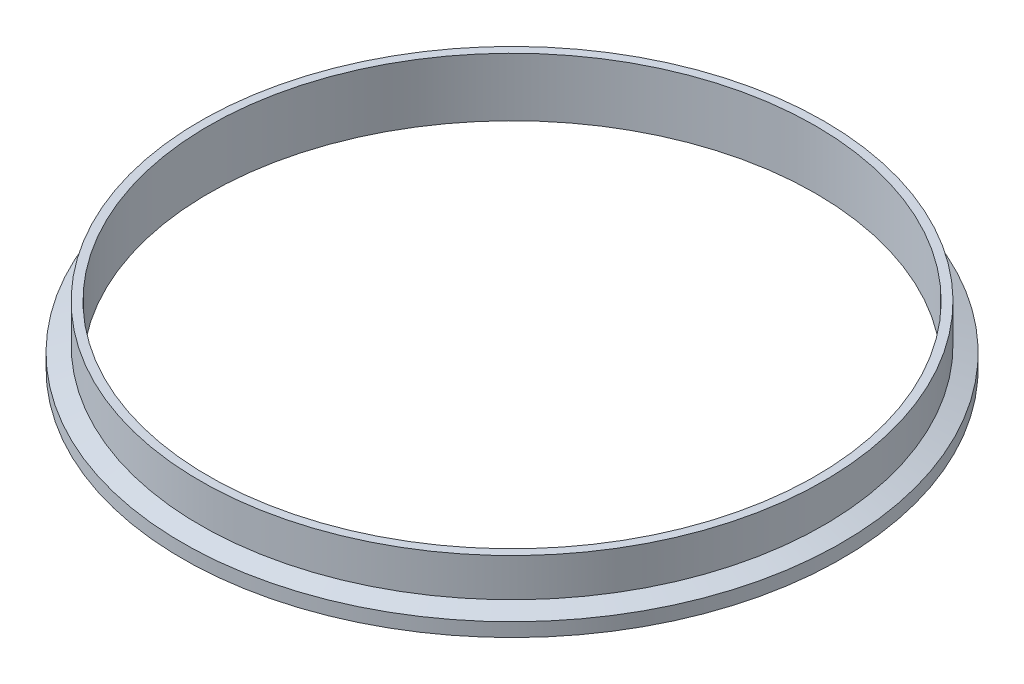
from build123d import *


with BuildPart() as part:
    # Sketch1 → Revolve2 (revolve)
    with BuildSketch(Plane.XY, mode=Mode.PRIVATE) as revolve2_sk:
        with BuildLine():
            Line((-123.5964, 0), (-123.5964, 23.8125))
            Line((-123.5964, 23.8125), (-127, 23.8125))
            Line((-127, 23.8125), (-127, 8.222780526))
            Line((-127, 8.222780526), (-134.239, 5.588))
            Line((-134.239, 5.588), (-134.239, 0))
            Line((-134.239, 0), (-130.799208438, 0))
            ThreePointArc((-130.799208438, 0), (-130.367011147, 0.129217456), (-130.076666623, 0.474458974))
            ThreePointArc((-130.076666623, 0.474458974), (-128.9812, 1.1938), (-127.885733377, 0.474458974))
            ThreePointArc((-127.885733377, 0.474458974), (-127.595388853, 0.129217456), (-127.163191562, 0))
            Line((-127.163191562, 0), (-123.5964, 0))
        make_face()
    revolve(revolve2_sk.sketch.rotate(Axis((0, 0, 0), (0, 1, 0)), 270), axis=Axis((0, 0, 0), (0, 1, 0)))


solid = part.part
